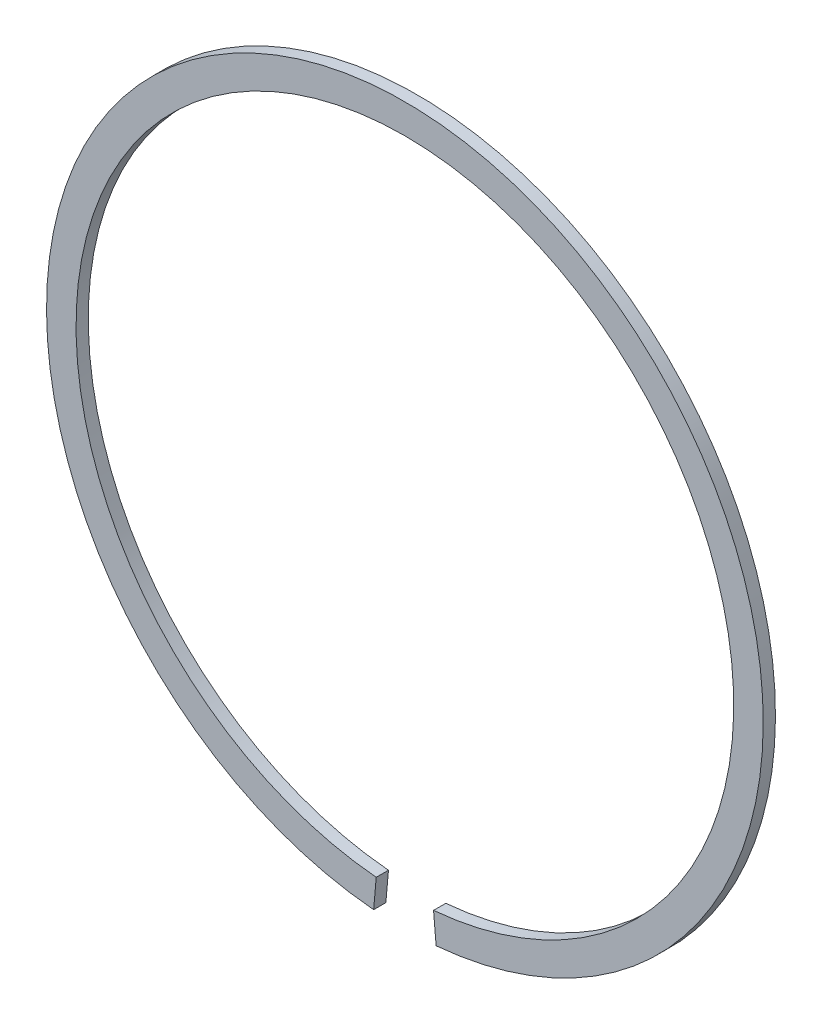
ISO-10303-21;
HEADER;
FILE_DESCRIPTION(('STEP AP214'),'2;1');
FILE_NAME('part.step','',(''),(''),'','','');
FILE_SCHEMA(('AUTOMOTIVE_DESIGN { 1 0 10303 214 1 1 1 1 }'));
ENDSEC;
DATA;
#1=APPLICATION_CONTEXT('core data for automotive mechanical design processes');
#2=APPLICATION_PROTOCOL_DEFINITION('international standard','automotive_design',2000,#1);
#3=PRODUCT_CONTEXT('',#1,'mechanical');
#4=PRODUCT('Part','Part','',(#3));
#5=PRODUCT_RELATED_PRODUCT_CATEGORY('part','',(#4));
#6=PRODUCT_DEFINITION_FORMATION('','',#4);
#7=PRODUCT_DEFINITION_CONTEXT('part definition',#1,'design');
#8=PRODUCT_DEFINITION('design','',#6,#7);
#9=PRODUCT_DEFINITION_SHAPE('','',#8);
#10=(LENGTH_UNIT() NAMED_UNIT(*) SI_UNIT(.MILLI.,.METRE.));
#11=(NAMED_UNIT(*) PLANE_ANGLE_UNIT() SI_UNIT($,.RADIAN.));
#12=(NAMED_UNIT(*) SI_UNIT($,.STERADIAN.) SOLID_ANGLE_UNIT());
#13=UNCERTAINTY_MEASURE_WITH_UNIT(LENGTH_MEASURE(1.E-05),#10,'distance_accuracy_value','');
#14=(GEOMETRIC_REPRESENTATION_CONTEXT(3) GLOBAL_UNCERTAINTY_ASSIGNED_CONTEXT((#13)) GLOBAL_UNIT_ASSIGNED_CONTEXT((#10,
#11,#12)) REPRESENTATION_CONTEXT('',''));
#15=CARTESIAN_POINT('',(0.,0.,0.));
#16=DIRECTION('',(0.,0.,1.));
#17=DIRECTION('',(1.,0.,0.));
#18=AXIS2_PLACEMENT_3D('',#15,#16,#17);
#19=CARTESIAN_POINT('',(0.,2.28983498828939E-13,0.85));
#20=DIRECTION('',(0.,0.,-1.));
#21=DIRECTION('',(-1.,0.,0.));
#22=AXIS2_PLACEMENT_3D('',#19,#20,#21);
#23=CYLINDRICAL_SURFACE('',#22,24.8999999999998);
#24=CARTESIAN_POINT('',(0.,2.28983498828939E-13,0.));
#25=DIRECTION('',(0.,0.,1.));
#26=DIRECTION('',(1.,0.,0.));
#27=AXIS2_PLACEMENT_3D('',#24,#25,#26);
#28=CIRCLE('',#27,24.8999999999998);
#29=CARTESIAN_POINT('',(2.1701779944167,-24.805247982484,0.));
#30=VERTEX_POINT('',#29);
#31=CARTESIAN_POINT('',(-2.1701779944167,-24.805247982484,0.));
#32=VERTEX_POINT('',#31);
#33=EDGE_CURVE('E95',#30,#32,#28,.T.);
#34=ORIENTED_EDGE('',*,*,#33,.T.);
#35=DIRECTION('',(0.,0.,-1.));
#36=VECTOR('',#35,1.);
#37=CARTESIAN_POINT('',(-2.1701779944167,-24.805247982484,0.85));
#38=LINE('',#37,#36);
#39=CARTESIAN_POINT('',(-2.1701779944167,-24.805247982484,0.85));
#40=VERTEX_POINT('',#39);
#41=EDGE_CURVE('E11',#40,#32,#38,.T.);
#42=ORIENTED_EDGE('',*,*,#41,.F.);
#43=CARTESIAN_POINT('',(0.,2.28983498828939E-13,0.85));
#44=DIRECTION('',(0.,0.,1.));
#45=DIRECTION('',(1.,0.,0.));
#46=AXIS2_PLACEMENT_3D('',#43,#44,#45);
#47=CIRCLE('',#46,24.8999999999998);
#48=CARTESIAN_POINT('',(2.1701779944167,-24.805247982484,0.85));
#49=VERTEX_POINT('',#48);
#50=EDGE_CURVE('E83',#49,#40,#47,.T.);
#51=ORIENTED_EDGE('',*,*,#50,.F.);
#52=DIRECTION('',(0.,0.,-1.));
#53=VECTOR('',#52,1.);
#54=CARTESIAN_POINT('',(2.1701779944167,-24.805247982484,0.85));
#55=LINE('',#54,#53);
#56=EDGE_CURVE('E91',#49,#30,#55,.T.);
#57=ORIENTED_EDGE('',*,*,#56,.T.);
#58=EDGE_LOOP('',(#34,#42,#51,#57));
#59=FACE_BOUND('',#58,.T.);
#60=ADVANCED_FACE('F32',(#59),#23,.T.);
#61=CARTESIAN_POINT('',(-2.1701779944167,-24.805247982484,0.85));
#62=DIRECTION('',(-0.996194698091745,0.0871557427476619,0.));
#63=DIRECTION('',(-0.0871557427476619,-0.996194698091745,0.));
#64=AXIS2_PLACEMENT_3D('',#61,#62,#63);
#65=PLANE('',#64);
#66=DIRECTION('',(0.0871557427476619,0.996194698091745,0.));
#67=VECTOR('',#66,1.);
#68=CARTESIAN_POINT('',(-2.1701779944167,-24.805247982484,0.));
#69=LINE('',#68,#67);
#70=CARTESIAN_POINT('',(-1.99150872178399,-22.763048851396,0.));
#71=VERTEX_POINT('',#70);
#72=EDGE_CURVE('E87',#32,#71,#69,.T.);
#73=ORIENTED_EDGE('',*,*,#72,.T.);
#74=DIRECTION('',(0.,0.,-1.));
#75=VECTOR('',#74,1.);
#76=CARTESIAN_POINT('',(-1.99150872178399,-22.763048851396,0.85));
#77=LINE('',#76,#75);
#78=CARTESIAN_POINT('',(-1.99150872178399,-22.763048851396,0.85));
#79=VERTEX_POINT('',#78);
#80=EDGE_CURVE('E40',#79,#71,#77,.T.);
#81=ORIENTED_EDGE('',*,*,#80,.F.);
#82=DIRECTION('',(0.0871557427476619,0.996194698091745,0.));
#83=VECTOR('',#82,1.);
#84=CARTESIAN_POINT('',(-2.1701779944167,-24.805247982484,0.85));
#85=LINE('',#84,#83);
#86=EDGE_CURVE('E78',#40,#79,#85,.T.);
#87=ORIENTED_EDGE('',*,*,#86,.F.);
#88=ORIENTED_EDGE('',*,*,#41,.T.);
#89=EDGE_LOOP('',(#73,#81,#87,#88));
#90=FACE_BOUND('',#89,.T.);
#91=ADVANCED_FACE('F86',(#90),#65,.F.);
#92=CARTESIAN_POINT('',(0.,2.28983498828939E-13,0.85));
#93=DIRECTION('',(0.,0.,-1.));
#94=DIRECTION('',(-1.,0.,0.));
#95=AXIS2_PLACEMENT_3D('',#92,#93,#94);
#96=CYLINDRICAL_SURFACE('',#95,22.8499999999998);
#97=CARTESIAN_POINT('',(0.,2.28983498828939E-13,0.));
#98=DIRECTION('',(0.,0.,-1.));
#99=DIRECTION('',(-1.,0.,0.));
#100=AXIS2_PLACEMENT_3D('',#97,#98,#99);
#101=CIRCLE('',#100,22.8499999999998);
#102=CARTESIAN_POINT('',(1.991508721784,-22.763048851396,0.));
#103=VERTEX_POINT('',#102);
#104=EDGE_CURVE('E65',#71,#103,#101,.T.);
#105=ORIENTED_EDGE('',*,*,#104,.T.);
#106=DIRECTION('',(0.,0.,-1.));
#107=VECTOR('',#106,1.);
#108=CARTESIAN_POINT('',(1.991508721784,-22.763048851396,0.85));
#109=LINE('',#108,#107);
#110=CARTESIAN_POINT('',(1.991508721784,-22.763048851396,0.85));
#111=VERTEX_POINT('',#110);
#112=EDGE_CURVE('E88',#111,#103,#109,.T.);
#113=ORIENTED_EDGE('',*,*,#112,.F.);
#114=CARTESIAN_POINT('',(0.,2.28983498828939E-13,0.85));
#115=DIRECTION('',(0.,0.,-1.));
#116=DIRECTION('',(-1.,0.,0.));
#117=AXIS2_PLACEMENT_3D('',#114,#115,#116);
#118=CIRCLE('',#117,22.8499999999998);
#119=EDGE_CURVE('E81',#79,#111,#118,.T.);
#120=ORIENTED_EDGE('',*,*,#119,.F.);
#121=ORIENTED_EDGE('',*,*,#80,.T.);
#122=EDGE_LOOP('',(#105,#113,#120,#121));
#123=FACE_BOUND('',#122,.T.);
#124=ADVANCED_FACE('F89',(#123),#96,.F.);
#125=CARTESIAN_POINT('',(1.991508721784,-22.763048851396,0.85));
#126=DIRECTION('',(0.996194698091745,0.0871557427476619,0.));
#127=DIRECTION('',(-0.0871557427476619,0.996194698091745,0.));
#128=AXIS2_PLACEMENT_3D('',#125,#126,#127);
#129=PLANE('',#128);
#130=DIRECTION('',(0.0871557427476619,-0.996194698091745,0.));
#131=VECTOR('',#130,1.);
#132=CARTESIAN_POINT('',(1.991508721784,-22.763048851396,0.));
#133=LINE('',#132,#131);
#134=EDGE_CURVE('E71',#103,#30,#133,.T.);
#135=ORIENTED_EDGE('',*,*,#134,.T.);
#136=ORIENTED_EDGE('',*,*,#56,.F.);
#137=DIRECTION('',(0.0871557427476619,-0.996194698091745,0.));
#138=VECTOR('',#137,1.);
#139=CARTESIAN_POINT('',(1.991508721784,-22.763048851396,0.85));
#140=LINE('',#139,#138);
#141=EDGE_CURVE('E48',#111,#49,#140,.T.);
#142=ORIENTED_EDGE('',*,*,#141,.F.);
#143=ORIENTED_EDGE('',*,*,#112,.T.);
#144=EDGE_LOOP('',(#135,#136,#142,#143));
#145=FACE_BOUND('',#144,.T.);
#146=ADVANCED_FACE('F102',(#145),#129,.F.);
#147=CARTESIAN_POINT('',(0.,2.28983498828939E-13,0.85));
#148=DIRECTION('',(0.,0.,1.));
#149=DIRECTION('',(1.,0.,0.));
#150=AXIS2_PLACEMENT_3D('',#147,#148,#149);
#151=PLANE('',#150);
#152=ORIENTED_EDGE('',*,*,#50,.T.);
#153=ORIENTED_EDGE('',*,*,#86,.T.);
#154=ORIENTED_EDGE('',*,*,#119,.T.);
#155=ORIENTED_EDGE('',*,*,#141,.T.);
#156=EDGE_LOOP('',(#152,#153,#154,#155));
#157=FACE_BOUND('',#156,.T.);
#158=ADVANCED_FACE('F79',(#157),#151,.T.);
#159=CARTESIAN_POINT('',(0.,2.28983498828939E-13,0.));
#160=DIRECTION('',(0.,0.,1.));
#161=DIRECTION('',(1.,0.,0.));
#162=AXIS2_PLACEMENT_3D('',#159,#160,#161);
#163=PLANE('',#162);
#164=ORIENTED_EDGE('',*,*,#33,.F.);
#165=ORIENTED_EDGE('',*,*,#134,.F.);
#166=ORIENTED_EDGE('',*,*,#104,.F.);
#167=ORIENTED_EDGE('',*,*,#72,.F.);
#168=EDGE_LOOP('',(#164,#165,#166,#167));
#169=FACE_BOUND('',#168,.T.);
#170=ADVANCED_FACE('F105',(#169),#163,.F.);
#171=CLOSED_SHELL('',(#60,#91,#124,#146,#158,#170));
#172=MANIFOLD_SOLID_BREP('B2',#171);
#173=ADVANCED_BREP_SHAPE_REPRESENTATION('',(#18,#172),#14);
#174=SHAPE_DEFINITION_REPRESENTATION(#9,#173);
ENDSEC;
END-ISO-10303-21;
